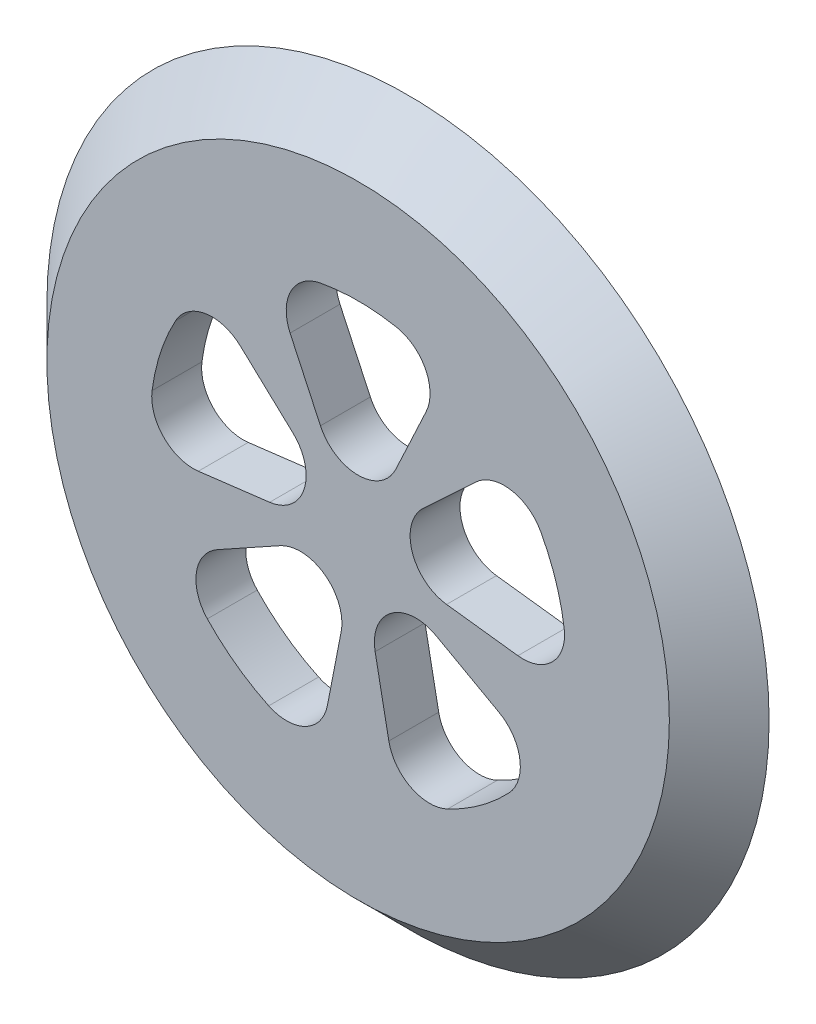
ISO-10303-21;
HEADER;
FILE_DESCRIPTION(('STEP AP214'),'2;1');
FILE_NAME('part.step','',(''),(''),'','','');
FILE_SCHEMA(('AUTOMOTIVE_DESIGN { 1 0 10303 214 1 1 1 1 }'));
ENDSEC;
DATA;
#1=APPLICATION_CONTEXT('core data for automotive mechanical design processes');
#2=APPLICATION_PROTOCOL_DEFINITION('international standard','automotive_design',2000,#1);
#3=PRODUCT_CONTEXT('',#1,'mechanical');
#4=PRODUCT('Part','Part','',(#3));
#5=PRODUCT_RELATED_PRODUCT_CATEGORY('part','',(#4));
#6=PRODUCT_DEFINITION_FORMATION('','',#4);
#7=PRODUCT_DEFINITION_CONTEXT('part definition',#1,'design');
#8=PRODUCT_DEFINITION('design','',#6,#7);
#9=PRODUCT_DEFINITION_SHAPE('','',#8);
#10=(LENGTH_UNIT() NAMED_UNIT(*) SI_UNIT(.MILLI.,.METRE.));
#11=(NAMED_UNIT(*) PLANE_ANGLE_UNIT() SI_UNIT($,.RADIAN.));
#12=(NAMED_UNIT(*) SI_UNIT($,.STERADIAN.) SOLID_ANGLE_UNIT());
#13=UNCERTAINTY_MEASURE_WITH_UNIT(LENGTH_MEASURE(1.E-05),#10,'distance_accuracy_value','');
#14=(GEOMETRIC_REPRESENTATION_CONTEXT(3) GLOBAL_UNCERTAINTY_ASSIGNED_CONTEXT((#13)) GLOBAL_UNIT_ASSIGNED_CONTEXT((#10,
#11,#12)) REPRESENTATION_CONTEXT('',''));
#15=CARTESIAN_POINT('',(0.,0.,0.));
#16=DIRECTION('',(0.,0.,1.));
#17=DIRECTION('',(1.,0.,0.));
#18=AXIS2_PLACEMENT_3D('',#15,#16,#17);
#19=CARTESIAN_POINT('',(0.,0.,0.));
#20=DIRECTION('',(0.,0.,-1.));
#21=DIRECTION('',(1.,0.,0.));
#22=AXIS2_PLACEMENT_3D('',#19,#20,#21);
#23=CONICAL_SURFACE('',#22,2172.,0.78539816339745);
#24=CARTESIAN_POINT('',(0.,0.,300.));
#25=DIRECTION('',(0.,0.,1.));
#26=DIRECTION('',(1.,0.,0.));
#27=AXIS2_PLACEMENT_3D('',#24,#25,#26);
#28=CIRCLE('',#27,1872.);
#29=CARTESIAN_POINT('',(1872.,0.,300.));
#30=VERTEX_POINT('',#29);
#31=EDGE_CURVE('E11',#30,#30,#28,.T.);
#32=ORIENTED_EDGE('',*,*,#31,.F.);
#33=EDGE_LOOP('',(#32));
#34=FACE_BOUND('',#33,.T.);
#35=CARTESIAN_POINT('',(0.,0.,0.));
#36=DIRECTION('',(0.,0.,1.));
#37=DIRECTION('',(1.,0.,0.));
#38=AXIS2_PLACEMENT_3D('',#35,#36,#37);
#39=CIRCLE('',#38,2172.);
#40=CARTESIAN_POINT('',(2172.,0.,0.));
#41=VERTEX_POINT('',#40);
#42=EDGE_CURVE('E44',#41,#41,#39,.T.);
#43=ORIENTED_EDGE('',*,*,#42,.T.);
#44=EDGE_LOOP('',(#43));
#45=FACE_BOUND('',#44,.T.);
#46=ADVANCED_FACE('F37',(#34,#45),#23,.T.);
#47=CARTESIAN_POINT('',(0.,0.,300.));
#48=DIRECTION('',(0.,0.,1.));
#49=DIRECTION('',(1.,0.,0.));
#50=AXIS2_PLACEMENT_3D('',#47,#48,#49);
#51=PLANE('',#50);
#52=CARTESIAN_POINT('',(991.49601476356,130.137053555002,300.));
#53=DIRECTION('',(0.,0.,1.));
#54=DIRECTION('',(-0.309016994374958,0.95105651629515,0.));
#55=AXIS2_PLACEMENT_3D('',#52,#53,#54);
#56=CIRCLE('',#55,250.);
#57=CARTESIAN_POINT('',(961.028678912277,-117.999484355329,300.));
#58=VERTEX_POINT('',#57);
#59=CARTESIAN_POINT('',(1239.37001845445,162.671316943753,300.));
#60=VERTEX_POINT('',#59);
#61=EDGE_CURVE('E51',#58,#60,#56,.T.);
#62=ORIENTED_EDGE('',*,*,#61,.F.);
#63=DIRECTION('',(0.992546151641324,-0.121869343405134,0.));
#64=VECTOR('',#63,1.);
#65=CARTESIAN_POINT('',(532.130522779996,-65.3374125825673,300.));
#66=LINE('',#65,#64);
#67=CARTESIAN_POINT('',(532.130522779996,-65.3374125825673,300.));
#68=VERTEX_POINT('',#67);
#69=EDGE_CURVE('E344',#68,#58,#66,.T.);
#70=ORIENTED_EDGE('',*,*,#69,.F.);
#71=CARTESIAN_POINT('',(562.597858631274,182.799125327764,300.));
#72=DIRECTION('',(0.,0.,1.));
#73=DIRECTION('',(0.309016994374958,-0.95105651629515,0.));
#74=AXIS2_PLACEMENT_3D('',#71,#72,#73);
#75=CIRCLE('',#74,250.);
#76=CARTESIAN_POINT('',(392.098268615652,365.637550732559,300.));
#77=VERTEX_POINT('',#76);
#78=EDGE_CURVE('E370',#77,#68,#75,.T.);
#79=ORIENTED_EDGE('',*,*,#78,.F.);
#80=DIRECTION('',(-0.731353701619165,-0.681998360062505,0.));
#81=VECTOR('',#80,1.);
#82=CARTESIAN_POINT('',(708.130176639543,660.342072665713,300.));
#83=LINE('',#82,#81);
#84=CARTESIAN_POINT('',(708.130176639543,660.342072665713,300.));
#85=VERTEX_POINT('',#84);
#86=EDGE_CURVE('E367',#85,#77,#83,.T.);
#87=ORIENTED_EDGE('',*,*,#86,.F.);
#88=CARTESIAN_POINT('',(878.629766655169,477.503647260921,300.));
#89=DIRECTION('',(0.,0.,1.));
#90=DIRECTION('',(0.309016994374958,-0.95105651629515,0.));
#91=AXIS2_PLACEMENT_3D('',#88,#89,#90);
#92=CIRCLE('',#91,250.);
#93=CARTESIAN_POINT('',(1098.28720831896,596.879559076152,300.));
#94=VERTEX_POINT('',#93);
#95=EDGE_CURVE('E364',#94,#85,#92,.T.);
#96=ORIENTED_EDGE('',*,*,#95,.F.);
#97=CARTESIAN_POINT('',(0.,0.,300.));
#98=DIRECTION('',(0.,0.,1.));
#99=DIRECTION('',(-0.309016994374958,0.95105651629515,0.));
#100=AXIS2_PLACEMENT_3D('',#97,#98,#99);
#101=CIRCLE('',#100,1250.);
#102=EDGE_CURVE('E361',#60,#94,#101,.T.);
#103=ORIENTED_EDGE('',*,*,#102,.F.);
#104=EDGE_LOOP('',(#62,#70,#79,#87,#96,#103));
#105=FACE_BOUND('',#104,.T.);
#106=CARTESIAN_POINT('',(430.156811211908,-902.754184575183,300.));
#107=DIRECTION('',(0.,0.,1.));
#108=DIRECTION('',(0.809016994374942,0.58778525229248,0.));
#109=AXIS2_PLACEMENT_3D('',#106,#107,#108);
#110=CIRCLE('',#109,250.);
#111=CARTESIAN_POINT('',(184.750015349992,-950.456433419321,300.));
#112=VERTEX_POINT('',#111);
#113=CARTESIAN_POINT('',(537.696014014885,-1128.44273071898,300.));
#114=VERTEX_POINT('',#113);
#115=EDGE_CURVE('E59',#112,#114,#110,.T.);
#116=ORIENTED_EDGE('',*,*,#115,.F.);
#117=DIRECTION('',(0.190808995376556,-0.981627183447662,0.));
#118=VECTOR('',#117,1.);
#119=CARTESIAN_POINT('',(102.297802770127,-526.276572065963,300.));
#120=LINE('',#119,#118);
#121=CARTESIAN_POINT('',(102.297802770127,-526.276572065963,300.));
#122=VERTEX_POINT('',#121);
#123=EDGE_CURVE('E298',#122,#112,#120,.T.);
#124=ORIENTED_EDGE('',*,*,#123,.F.);
#125=CARTESIAN_POINT('',(347.704598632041,-478.574323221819,300.));
#126=DIRECTION('',(0.,0.,1.));
#127=DIRECTION('',(-0.809016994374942,-0.58778525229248,0.));
#128=AXIS2_PLACEMENT_3D('',#125,#126,#127);
#129=CIRCLE('',#128,250.);
#130=CARTESIAN_POINT('',(468.907003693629,-259.919396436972,300.));
#131=VERTEX_POINT('',#130);
#132=EDGE_CURVE('E325',#131,#122,#129,.T.);
#133=ORIENTED_EDGE('',*,*,#132,.F.);
#134=DIRECTION('',(-0.874619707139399,0.484809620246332,0.));
#135=VECTOR('',#134,1.);
#136=CARTESIAN_POINT('',(846.846890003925,-469.414896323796,300.));
#137=LINE('',#136,#135);
#138=CARTESIAN_POINT('',(846.846890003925,-469.414896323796,300.));
#139=VERTEX_POINT('',#138);
#140=EDGE_CURVE('E322',#139,#131,#137,.T.);
#141=ORIENTED_EDGE('',*,*,#140,.F.);
#142=CARTESIAN_POINT('',(725.644484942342,-688.069823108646,300.));
#143=DIRECTION('',(0.,0.,1.));
#144=DIRECTION('',(-0.809016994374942,-0.58778525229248,0.));
#145=AXIS2_PLACEMENT_3D('',#142,#143,#144);
#146=CIRCLE('',#145,250.);
#147=CARTESIAN_POINT('',(907.055606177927,-860.087278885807,300.));
#148=VERTEX_POINT('',#147);
#149=EDGE_CURVE('E319',#148,#139,#146,.T.);
#150=ORIENTED_EDGE('',*,*,#149,.F.);
#151=CARTESIAN_POINT('',(0.,0.,300.));
#152=DIRECTION('',(0.,0.,1.));
#153=DIRECTION('',(0.809016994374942,0.58778525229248,0.));
#154=AXIS2_PLACEMENT_3D('',#151,#152,#153);
#155=CIRCLE('',#154,1250.);
#156=EDGE_CURVE('E315',#114,#148,#155,.T.);
#157=ORIENTED_EDGE('',*,*,#156,.F.);
#158=EDGE_LOOP('',(#116,#124,#133,#141,#150,#157));
#159=FACE_BOUND('',#158,.T.);
#160=CARTESIAN_POINT('',(-725.644484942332,-688.069823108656,300.));
#161=DIRECTION('',(0.,0.,1.));
#162=DIRECTION('',(0.809016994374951,-0.587785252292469,0.));
#163=AXIS2_PLACEMENT_3D('',#160,#161,#162);
#164=CIRCLE('',#163,250.);
#165=CARTESIAN_POINT('',(-846.846890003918,-469.414896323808,300.));
#166=VERTEX_POINT('',#165);
#167=CARTESIAN_POINT('',(-907.055606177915,-860.087278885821,300.));
#168=VERTEX_POINT('',#167);
#169=EDGE_CURVE('E240',#166,#168,#164,.T.);
#170=ORIENTED_EDGE('',*,*,#169,.F.);
#171=DIRECTION('',(-0.874619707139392,-0.484809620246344,0.));
#172=VECTOR('',#171,1.);
#173=CARTESIAN_POINT('',(-468.907003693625,-259.919396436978,300.));
#174=LINE('',#173,#172);
#175=CARTESIAN_POINT('',(-468.907003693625,-259.919396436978,300.));
#176=VERTEX_POINT('',#175);
#177=EDGE_CURVE('E259',#176,#166,#174,.T.);
#178=ORIENTED_EDGE('',*,*,#177,.F.);
#179=CARTESIAN_POINT('',(-347.704598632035,-478.574323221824,300.));
#180=DIRECTION('',(0.,0.,1.));
#181=DIRECTION('',(-0.809016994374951,0.587785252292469,0.));
#182=AXIS2_PLACEMENT_3D('',#179,#180,#181);
#183=CIRCLE('',#182,250.);
#184=CARTESIAN_POINT('',(-102.297802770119,-526.276572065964,300.));
#185=VERTEX_POINT('',#184);
#186=EDGE_CURVE('E262',#185,#176,#183,.T.);
#187=ORIENTED_EDGE('',*,*,#186,.F.);
#188=DIRECTION('',(0.190808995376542,0.981627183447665,0.));
#189=VECTOR('',#188,1.);
#190=CARTESIAN_POINT('',(-184.750015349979,-950.456433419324,300.));
#191=LINE('',#190,#189);
#192=CARTESIAN_POINT('',(-184.750015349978,-950.456433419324,300.));
#193=VERTEX_POINT('',#192);
#194=EDGE_CURVE('E279',#193,#185,#191,.T.);
#195=ORIENTED_EDGE('',*,*,#194,.F.);
#196=CARTESIAN_POINT('',(-430.156811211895,-902.754184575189,300.));
#197=DIRECTION('',(0.,0.,1.));
#198=DIRECTION('',(-0.809016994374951,0.587785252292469,0.));
#199=AXIS2_PLACEMENT_3D('',#196,#197,#198);
#200=CIRCLE('',#199,250.);
#201=CARTESIAN_POINT('',(-537.696014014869,-1128.44273071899,300.));
#202=VERTEX_POINT('',#201);
#203=EDGE_CURVE('E276',#202,#193,#200,.T.);
#204=ORIENTED_EDGE('',*,*,#203,.F.);
#205=CARTESIAN_POINT('',(0.,0.,300.));
#206=DIRECTION('',(0.,0.,1.));
#207=DIRECTION('',(0.809016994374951,-0.587785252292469,0.));
#208=AXIS2_PLACEMENT_3D('',#205,#206,#207);
#209=CIRCLE('',#208,1250.);
#210=EDGE_CURVE('E273',#168,#202,#209,.T.);
#211=ORIENTED_EDGE('',*,*,#210,.F.);
#212=EDGE_LOOP('',(#170,#178,#187,#195,#204,#211));
#213=FACE_BOUND('',#212,.T.);
#214=CARTESIAN_POINT('',(-878.629766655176,477.503647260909,300.));
#215=DIRECTION('',(0.,0.,1.));
#216=DIRECTION('',(-0.309016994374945,-0.951056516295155,0.));
#217=AXIS2_PLACEMENT_3D('',#214,#215,#216);
#218=CIRCLE('',#217,250.);
#219=CARTESIAN_POINT('',(-708.130176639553,660.342072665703,300.));
#220=VERTEX_POINT('',#219);
#221=CARTESIAN_POINT('',(-1098.28720831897,596.879559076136,300.));
#222=VERTEX_POINT('',#221);
#223=EDGE_CURVE('E286',#220,#222,#218,.T.);
#224=ORIENTED_EDGE('',*,*,#223,.F.);
#225=DIRECTION('',(-0.731353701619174,0.681998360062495,0.));
#226=VECTOR('',#225,1.);
#227=CARTESIAN_POINT('',(-392.098268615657,365.637550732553,300.));
#228=LINE('',#227,#226);
#229=CARTESIAN_POINT('',(-392.098268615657,365.637550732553,300.));
#230=VERTEX_POINT('',#229);
#231=EDGE_CURVE('E389',#230,#220,#228,.T.);
#232=ORIENTED_EDGE('',*,*,#231,.F.);
#233=CARTESIAN_POINT('',(-562.597858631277,182.799125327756,300.));
#234=DIRECTION('',(0.,0.,1.));
#235=DIRECTION('',(0.309016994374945,0.951056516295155,0.));
#236=AXIS2_PLACEMENT_3D('',#233,#234,#235);
#237=CIRCLE('',#236,250.);
#238=CARTESIAN_POINT('',(-532.130522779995,-65.3374125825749,300.));
#239=VERTEX_POINT('',#238);
#240=EDGE_CURVE('E415',#239,#230,#237,.T.);
#241=ORIENTED_EDGE('',*,*,#240,.F.);
#242=DIRECTION('',(0.992546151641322,0.121869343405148,0.));
#243=VECTOR('',#242,1.);
#244=CARTESIAN_POINT('',(-961.028678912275,-117.999484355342,300.));
#245=LINE('',#244,#243);
#246=CARTESIAN_POINT('',(-961.028678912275,-117.999484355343,300.));
#247=VERTEX_POINT('',#246);
#248=EDGE_CURVE('E412',#247,#239,#245,.T.);
#249=ORIENTED_EDGE('',*,*,#248,.F.);
#250=CARTESIAN_POINT('',(-991.496014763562,130.137053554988,300.));
#251=DIRECTION('',(0.,0.,1.));
#252=DIRECTION('',(0.309016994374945,0.951056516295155,0.));
#253=AXIS2_PLACEMENT_3D('',#250,#251,#252);
#254=CIRCLE('',#253,250.);
#255=CARTESIAN_POINT('',(-1239.37001845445,162.671316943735,300.));
#256=VERTEX_POINT('',#255);
#257=EDGE_CURVE('E409',#256,#247,#254,.T.);
#258=ORIENTED_EDGE('',*,*,#257,.F.);
#259=CARTESIAN_POINT('',(0.,0.,300.));
#260=DIRECTION('',(0.,0.,1.));
#261=DIRECTION('',(-0.309016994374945,-0.951056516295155,0.));
#262=AXIS2_PLACEMENT_3D('',#259,#260,#261);
#263=CIRCLE('',#262,1250.);
#264=EDGE_CURVE('E406',#222,#256,#263,.T.);
#265=ORIENTED_EDGE('',*,*,#264,.F.);
#266=EDGE_LOOP('',(#224,#232,#241,#249,#258,#265));
#267=FACE_BOUND('',#266,.T.);
#268=CARTESIAN_POINT('',(182.621425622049,983.183306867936,300.));
#269=DIRECTION('',(0.,0.,1.));
#270=DIRECTION('',(-1.,0.,0.));
#271=AXIS2_PLACEMENT_3D('',#268,#269,#270);
#272=CIRCLE('',#271,250.);
#273=CARTESIAN_POINT('',(409.198372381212,877.528741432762,300.));
#274=VERTEX_POINT('',#273);
#275=CARTESIAN_POINT('',(228.276782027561,1228.97913358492,300.));
#276=VERTEX_POINT('',#275);
#277=EDGE_CURVE('E422',#274,#276,#272,.T.);
#278=ORIENTED_EDGE('',*,*,#277,.F.);
#279=DIRECTION('',(0.422618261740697,0.906307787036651,0.));
#280=VECTOR('',#279,1.);
#281=CARTESIAN_POINT('',(226.576946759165,485.895830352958,300.));
#282=LINE('',#281,#280);
#283=CARTESIAN_POINT('',(226.576946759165,485.895830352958,300.));
#284=VERTEX_POINT('',#283);
#285=EDGE_CURVE('E437',#284,#274,#282,.T.);
#286=ORIENTED_EDGE('',*,*,#285,.F.);
#287=CARTESIAN_POINT('',(0.,591.550395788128,300.));
#288=DIRECTION('',(0.,0.,1.));
#289=DIRECTION('',(1.,0.,0.));
#290=AXIS2_PLACEMENT_3D('',#287,#288,#289);
#291=CIRCLE('',#290,250.);
#292=CARTESIAN_POINT('',(-226.576946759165,485.895830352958,300.));
#293=VERTEX_POINT('',#292);
#294=EDGE_CURVE('E463',#293,#284,#291,.T.);
#295=ORIENTED_EDGE('',*,*,#294,.F.);
#296=DIRECTION('',(0.422618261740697,-0.906307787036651,0.));
#297=VECTOR('',#296,1.);
#298=CARTESIAN_POINT('',(-409.198372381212,877.528741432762,300.));
#299=LINE('',#298,#297);
#300=CARTESIAN_POINT('',(-409.198372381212,877.528741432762,300.));
#301=VERTEX_POINT('',#300);
#302=EDGE_CURVE('E460',#301,#293,#299,.T.);
#303=ORIENTED_EDGE('',*,*,#302,.F.);
#304=CARTESIAN_POINT('',(-182.621425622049,983.183306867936,300.));
#305=DIRECTION('',(0.,0.,1.));
#306=DIRECTION('',(1.,0.,0.));
#307=AXIS2_PLACEMENT_3D('',#304,#305,#306);
#308=CIRCLE('',#307,250.);
#309=CARTESIAN_POINT('',(-228.276782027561,1228.97913358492,300.));
#310=VERTEX_POINT('',#309);
#311=EDGE_CURVE('E457',#310,#301,#308,.T.);
#312=ORIENTED_EDGE('',*,*,#311,.F.);
#313=CARTESIAN_POINT('',(0.,0.,300.));
#314=DIRECTION('',(0.,0.,1.));
#315=DIRECTION('',(-1.,0.,0.));
#316=AXIS2_PLACEMENT_3D('',#313,#314,#315);
#317=CIRCLE('',#316,1250.);
#318=EDGE_CURVE('E454',#276,#310,#317,.T.);
#319=ORIENTED_EDGE('',*,*,#318,.F.);
#320=EDGE_LOOP('',(#278,#286,#295,#303,#312,#319));
#321=FACE_BOUND('',#320,.T.);
#322=ORIENTED_EDGE('',*,*,#31,.T.);
#323=EDGE_LOOP('',(#322));
#324=FACE_BOUND('',#323,.T.);
#325=ADVANCED_FACE('F485',(#105,#159,#213,#267,#321,#324),#51,.T.);
#326=CARTESIAN_POINT('',(0.,0.,0.));
#327=DIRECTION('',(0.,0.,1.));
#328=DIRECTION('',(1.,0.,0.));
#329=AXIS2_PLACEMENT_3D('',#326,#327,#328);
#330=PLANE('',#329);
#331=DIRECTION('',(0.992546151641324,-0.121869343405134,0.));
#332=VECTOR('',#331,1.);
#333=CARTESIAN_POINT('',(532.130522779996,-65.3374125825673,0.));
#334=LINE('',#333,#332);
#335=CARTESIAN_POINT('',(532.130522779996,-65.3374125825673,0.));
#336=VERTEX_POINT('',#335);
#337=CARTESIAN_POINT('',(961.028678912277,-117.999484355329,0.));
#338=VERTEX_POINT('',#337);
#339=EDGE_CURVE('E356',#336,#338,#334,.T.);
#340=ORIENTED_EDGE('',*,*,#339,.T.);
#341=CARTESIAN_POINT('',(991.49601476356,130.137053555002,0.));
#342=DIRECTION('',(0.,0.,1.));
#343=DIRECTION('',(-0.309016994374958,0.95105651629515,0.));
#344=AXIS2_PLACEMENT_3D('',#341,#342,#343);
#345=CIRCLE('',#344,250.);
#346=CARTESIAN_POINT('',(1239.37001845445,162.671316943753,0.));
#347=VERTEX_POINT('',#346);
#348=EDGE_CURVE('E340',#338,#347,#345,.T.);
#349=ORIENTED_EDGE('',*,*,#348,.T.);
#350=CARTESIAN_POINT('',(0.,0.,0.));
#351=DIRECTION('',(0.,0.,1.));
#352=DIRECTION('',(-0.309016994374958,0.95105651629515,0.));
#353=AXIS2_PLACEMENT_3D('',#350,#351,#352);
#354=CIRCLE('',#353,1250.);
#355=CARTESIAN_POINT('',(1098.28720831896,596.879559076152,0.));
#356=VERTEX_POINT('',#355);
#357=EDGE_CURVE('E343',#347,#356,#354,.T.);
#358=ORIENTED_EDGE('',*,*,#357,.T.);
#359=CARTESIAN_POINT('',(878.629766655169,477.503647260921,0.));
#360=DIRECTION('',(0.,0.,1.));
#361=DIRECTION('',(0.309016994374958,-0.95105651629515,0.));
#362=AXIS2_PLACEMENT_3D('',#359,#360,#361);
#363=CIRCLE('',#362,250.);
#364=CARTESIAN_POINT('',(708.130176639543,660.342072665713,0.));
#365=VERTEX_POINT('',#364);
#366=EDGE_CURVE('E347',#356,#365,#363,.T.);
#367=ORIENTED_EDGE('',*,*,#366,.T.);
#368=DIRECTION('',(-0.731353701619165,-0.681998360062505,0.));
#369=VECTOR('',#368,1.);
#370=CARTESIAN_POINT('',(708.130176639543,660.342072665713,0.));
#371=LINE('',#370,#369);
#372=CARTESIAN_POINT('',(392.098268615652,365.637550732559,0.));
#373=VERTEX_POINT('',#372);
#374=EDGE_CURVE('E350',#365,#373,#371,.T.);
#375=ORIENTED_EDGE('',*,*,#374,.T.);
#376=CARTESIAN_POINT('',(562.597858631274,182.799125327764,0.));
#377=DIRECTION('',(0.,0.,1.));
#378=DIRECTION('',(0.309016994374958,-0.95105651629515,0.));
#379=AXIS2_PLACEMENT_3D('',#376,#377,#378);
#380=CIRCLE('',#379,250.);
#381=EDGE_CURVE('E353',#373,#336,#380,.T.);
#382=ORIENTED_EDGE('',*,*,#381,.T.);
#383=EDGE_LOOP('',(#340,#349,#358,#367,#375,#382));
#384=FACE_BOUND('',#383,.T.);
#385=DIRECTION('',(0.190808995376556,-0.981627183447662,0.));
#386=VECTOR('',#385,1.);
#387=CARTESIAN_POINT('',(102.297802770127,-526.276572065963,0.));
#388=LINE('',#387,#386);
#389=CARTESIAN_POINT('',(102.297802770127,-526.276572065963,0.));
#390=VERTEX_POINT('',#389);
#391=CARTESIAN_POINT('',(184.750015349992,-950.456433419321,0.));
#392=VERTEX_POINT('',#391);
#393=EDGE_CURVE('E310',#390,#392,#388,.T.);
#394=ORIENTED_EDGE('',*,*,#393,.T.);
#395=CARTESIAN_POINT('',(430.156811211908,-902.754184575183,0.));
#396=DIRECTION('',(0.,0.,1.));
#397=DIRECTION('',(0.809016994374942,0.58778525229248,0.));
#398=AXIS2_PLACEMENT_3D('',#395,#396,#397);
#399=CIRCLE('',#398,250.);
#400=CARTESIAN_POINT('',(537.696014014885,-1128.44273071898,0.));
#401=VERTEX_POINT('',#400);
#402=EDGE_CURVE('E294',#392,#401,#399,.T.);
#403=ORIENTED_EDGE('',*,*,#402,.T.);
#404=CARTESIAN_POINT('',(0.,0.,0.));
#405=DIRECTION('',(0.,0.,1.));
#406=DIRECTION('',(0.809016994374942,0.58778525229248,0.));
#407=AXIS2_PLACEMENT_3D('',#404,#405,#406);
#408=CIRCLE('',#407,1250.);
#409=CARTESIAN_POINT('',(907.055606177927,-860.087278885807,0.));
#410=VERTEX_POINT('',#409);
#411=EDGE_CURVE('E297',#401,#410,#408,.T.);
#412=ORIENTED_EDGE('',*,*,#411,.T.);
#413=CARTESIAN_POINT('',(725.644484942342,-688.069823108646,0.));
#414=DIRECTION('',(0.,0.,1.));
#415=DIRECTION('',(-0.809016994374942,-0.58778525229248,0.));
#416=AXIS2_PLACEMENT_3D('',#413,#414,#415);
#417=CIRCLE('',#416,250.);
#418=CARTESIAN_POINT('',(846.846890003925,-469.414896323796,0.));
#419=VERTEX_POINT('',#418);
#420=EDGE_CURVE('E301',#410,#419,#417,.T.);
#421=ORIENTED_EDGE('',*,*,#420,.T.);
#422=DIRECTION('',(-0.874619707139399,0.484809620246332,0.));
#423=VECTOR('',#422,1.);
#424=CARTESIAN_POINT('',(846.846890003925,-469.414896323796,0.));
#425=LINE('',#424,#423);
#426=CARTESIAN_POINT('',(468.907003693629,-259.919396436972,0.));
#427=VERTEX_POINT('',#426);
#428=EDGE_CURVE('E304',#419,#427,#425,.T.);
#429=ORIENTED_EDGE('',*,*,#428,.T.);
#430=CARTESIAN_POINT('',(347.704598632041,-478.574323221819,0.));
#431=DIRECTION('',(0.,0.,1.));
#432=DIRECTION('',(-0.809016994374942,-0.58778525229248,0.));
#433=AXIS2_PLACEMENT_3D('',#430,#431,#432);
#434=CIRCLE('',#433,250.);
#435=EDGE_CURVE('E307',#427,#390,#434,.T.);
#436=ORIENTED_EDGE('',*,*,#435,.T.);
#437=EDGE_LOOP('',(#394,#403,#412,#421,#429,#436));
#438=FACE_BOUND('',#437,.T.);
#439=DIRECTION('',(-0.874619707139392,-0.484809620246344,0.));
#440=VECTOR('',#439,1.);
#441=CARTESIAN_POINT('',(-468.907003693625,-259.919396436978,0.));
#442=LINE('',#441,#440);
#443=CARTESIAN_POINT('',(-468.907003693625,-259.919396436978,0.));
#444=VERTEX_POINT('',#443);
#445=CARTESIAN_POINT('',(-846.846890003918,-469.414896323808,0.));
#446=VERTEX_POINT('',#445);
#447=EDGE_CURVE('E245',#444,#446,#442,.T.);
#448=ORIENTED_EDGE('',*,*,#447,.T.);
#449=CARTESIAN_POINT('',(-725.644484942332,-688.069823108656,0.));
#450=DIRECTION('',(0.,0.,1.));
#451=DIRECTION('',(0.809016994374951,-0.587785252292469,0.));
#452=AXIS2_PLACEMENT_3D('',#449,#450,#451);
#453=CIRCLE('',#452,250.);
#454=CARTESIAN_POINT('',(-907.055606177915,-860.087278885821,0.));
#455=VERTEX_POINT('',#454);
#456=EDGE_CURVE('E237',#446,#455,#453,.T.);
#457=ORIENTED_EDGE('',*,*,#456,.T.);
#458=CARTESIAN_POINT('',(0.,0.,0.));
#459=DIRECTION('',(0.,0.,1.));
#460=DIRECTION('',(0.809016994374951,-0.587785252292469,0.));
#461=AXIS2_PLACEMENT_3D('',#458,#459,#460);
#462=CIRCLE('',#461,1250.);
#463=CARTESIAN_POINT('',(-537.696014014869,-1128.44273071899,0.));
#464=VERTEX_POINT('',#463);
#465=EDGE_CURVE('E249',#455,#464,#462,.T.);
#466=ORIENTED_EDGE('',*,*,#465,.T.);
#467=CARTESIAN_POINT('',(-430.156811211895,-902.754184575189,0.));
#468=DIRECTION('',(0.,0.,1.));
#469=DIRECTION('',(-0.809016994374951,0.587785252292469,0.));
#470=AXIS2_PLACEMENT_3D('',#467,#468,#469);
#471=CIRCLE('',#470,250.);
#472=CARTESIAN_POINT('',(-184.750015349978,-950.456433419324,0.));
#473=VERTEX_POINT('',#472);
#474=EDGE_CURVE('E253',#464,#473,#471,.T.);
#475=ORIENTED_EDGE('',*,*,#474,.T.);
#476=DIRECTION('',(0.190808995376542,0.981627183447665,0.));
#477=VECTOR('',#476,1.);
#478=CARTESIAN_POINT('',(-184.750015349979,-950.456433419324,0.));
#479=LINE('',#478,#477);
#480=CARTESIAN_POINT('',(-102.297802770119,-526.276572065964,0.));
#481=VERTEX_POINT('',#480);
#482=EDGE_CURVE('E266',#473,#481,#479,.T.);
#483=ORIENTED_EDGE('',*,*,#482,.T.);
#484=CARTESIAN_POINT('',(-347.704598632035,-478.574323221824,0.));
#485=DIRECTION('',(0.,0.,1.));
#486=DIRECTION('',(-0.809016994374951,0.587785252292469,0.));
#487=AXIS2_PLACEMENT_3D('',#484,#485,#486);
#488=CIRCLE('',#487,250.);
#489=EDGE_CURVE('E269',#481,#444,#488,.T.);
#490=ORIENTED_EDGE('',*,*,#489,.T.);
#491=EDGE_LOOP('',(#448,#457,#466,#475,#483,#490));
#492=FACE_BOUND('',#491,.T.);
#493=DIRECTION('',(-0.731353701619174,0.681998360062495,0.));
#494=VECTOR('',#493,1.);
#495=CARTESIAN_POINT('',(-392.098268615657,365.637550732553,0.));
#496=LINE('',#495,#494);
#497=CARTESIAN_POINT('',(-392.098268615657,365.637550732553,0.));
#498=VERTEX_POINT('',#497);
#499=CARTESIAN_POINT('',(-708.130176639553,660.342072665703,0.));
#500=VERTEX_POINT('',#499);
#501=EDGE_CURVE('E401',#498,#500,#496,.T.);
#502=ORIENTED_EDGE('',*,*,#501,.T.);
#503=CARTESIAN_POINT('',(-878.629766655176,477.503647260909,0.));
#504=DIRECTION('',(0.,0.,1.));
#505=DIRECTION('',(-0.309016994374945,-0.951056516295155,0.));
#506=AXIS2_PLACEMENT_3D('',#503,#504,#505);
#507=CIRCLE('',#506,250.);
#508=CARTESIAN_POINT('',(-1098.28720831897,596.879559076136,0.));
#509=VERTEX_POINT('',#508);
#510=EDGE_CURVE('E385',#500,#509,#507,.T.);
#511=ORIENTED_EDGE('',*,*,#510,.T.);
#512=CARTESIAN_POINT('',(0.,0.,0.));
#513=DIRECTION('',(0.,0.,1.));
#514=DIRECTION('',(-0.309016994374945,-0.951056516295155,0.));
#515=AXIS2_PLACEMENT_3D('',#512,#513,#514);
#516=CIRCLE('',#515,1250.);
#517=CARTESIAN_POINT('',(-1239.37001845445,162.671316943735,0.));
#518=VERTEX_POINT('',#517);
#519=EDGE_CURVE('E388',#509,#518,#516,.T.);
#520=ORIENTED_EDGE('',*,*,#519,.T.);
#521=CARTESIAN_POINT('',(-991.496014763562,130.137053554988,0.));
#522=DIRECTION('',(0.,0.,1.));
#523=DIRECTION('',(0.309016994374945,0.951056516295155,0.));
#524=AXIS2_PLACEMENT_3D('',#521,#522,#523);
#525=CIRCLE('',#524,250.);
#526=CARTESIAN_POINT('',(-961.028678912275,-117.999484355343,0.));
#527=VERTEX_POINT('',#526);
#528=EDGE_CURVE('E392',#518,#527,#525,.T.);
#529=ORIENTED_EDGE('',*,*,#528,.T.);
#530=DIRECTION('',(0.992546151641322,0.121869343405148,0.));
#531=VECTOR('',#530,1.);
#532=CARTESIAN_POINT('',(-961.028678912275,-117.999484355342,0.));
#533=LINE('',#532,#531);
#534=CARTESIAN_POINT('',(-532.130522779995,-65.3374125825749,0.));
#535=VERTEX_POINT('',#534);
#536=EDGE_CURVE('E395',#527,#535,#533,.T.);
#537=ORIENTED_EDGE('',*,*,#536,.T.);
#538=CARTESIAN_POINT('',(-562.597858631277,182.799125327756,0.));
#539=DIRECTION('',(0.,0.,1.));
#540=DIRECTION('',(0.309016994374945,0.951056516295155,0.));
#541=AXIS2_PLACEMENT_3D('',#538,#539,#540);
#542=CIRCLE('',#541,250.);
#543=EDGE_CURVE('E398',#535,#498,#542,.T.);
#544=ORIENTED_EDGE('',*,*,#543,.T.);
#545=EDGE_LOOP('',(#502,#511,#520,#529,#537,#544));
#546=FACE_BOUND('',#545,.T.);
#547=DIRECTION('',(0.422618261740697,0.906307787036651,0.));
#548=VECTOR('',#547,1.);
#549=CARTESIAN_POINT('',(226.576946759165,485.895830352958,0.));
#550=LINE('',#549,#548);
#551=CARTESIAN_POINT('',(226.576946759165,485.895830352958,0.));
#552=VERTEX_POINT('',#551);
#553=CARTESIAN_POINT('',(409.198372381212,877.528741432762,0.));
#554=VERTEX_POINT('',#553);
#555=EDGE_CURVE('E449',#552,#554,#550,.T.);
#556=ORIENTED_EDGE('',*,*,#555,.T.);
#557=CARTESIAN_POINT('',(182.621425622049,983.183306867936,0.));
#558=DIRECTION('',(0.,0.,1.));
#559=DIRECTION('',(-1.,0.,0.));
#560=AXIS2_PLACEMENT_3D('',#557,#558,#559);
#561=CIRCLE('',#560,250.);
#562=CARTESIAN_POINT('',(228.276782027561,1228.97913358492,0.));
#563=VERTEX_POINT('',#562);
#564=EDGE_CURVE('E433',#554,#563,#561,.T.);
#565=ORIENTED_EDGE('',*,*,#564,.T.);
#566=CARTESIAN_POINT('',(0.,0.,0.));
#567=DIRECTION('',(0.,0.,1.));
#568=DIRECTION('',(-1.,0.,0.));
#569=AXIS2_PLACEMENT_3D('',#566,#567,#568);
#570=CIRCLE('',#569,1250.);
#571=CARTESIAN_POINT('',(-228.276782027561,1228.97913358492,0.));
#572=VERTEX_POINT('',#571);
#573=EDGE_CURVE('E436',#563,#572,#570,.T.);
#574=ORIENTED_EDGE('',*,*,#573,.T.);
#575=CARTESIAN_POINT('',(-182.621425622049,983.183306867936,0.));
#576=DIRECTION('',(0.,0.,1.));
#577=DIRECTION('',(1.,0.,0.));
#578=AXIS2_PLACEMENT_3D('',#575,#576,#577);
#579=CIRCLE('',#578,250.);
#580=CARTESIAN_POINT('',(-409.198372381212,877.528741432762,0.));
#581=VERTEX_POINT('',#580);
#582=EDGE_CURVE('E440',#572,#581,#579,.T.);
#583=ORIENTED_EDGE('',*,*,#582,.T.);
#584=DIRECTION('',(0.422618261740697,-0.906307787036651,0.));
#585=VECTOR('',#584,1.);
#586=CARTESIAN_POINT('',(-409.198372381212,877.528741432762,0.));
#587=LINE('',#586,#585);
#588=CARTESIAN_POINT('',(-226.576946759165,485.895830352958,0.));
#589=VERTEX_POINT('',#588);
#590=EDGE_CURVE('E443',#581,#589,#587,.T.);
#591=ORIENTED_EDGE('',*,*,#590,.T.);
#592=CARTESIAN_POINT('',(0.,591.550395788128,0.));
#593=DIRECTION('',(0.,0.,1.));
#594=DIRECTION('',(1.,0.,0.));
#595=AXIS2_PLACEMENT_3D('',#592,#593,#594);
#596=CIRCLE('',#595,250.);
#597=EDGE_CURVE('E446',#589,#552,#596,.T.);
#598=ORIENTED_EDGE('',*,*,#597,.T.);
#599=EDGE_LOOP('',(#556,#565,#574,#583,#591,#598));
#600=FACE_BOUND('',#599,.T.);
#601=ORIENTED_EDGE('',*,*,#42,.F.);
#602=EDGE_LOOP('',(#601));
#603=FACE_BOUND('',#602,.T.);
#604=ADVANCED_FACE('F255',(#384,#438,#492,#546,#600,#603),#330,.F.);
#605=CARTESIAN_POINT('',(182.621425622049,983.183306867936,0.));
#606=DIRECTION('',(0.,0.,1.));
#607=DIRECTION('',(1.,0.,0.));
#608=AXIS2_PLACEMENT_3D('',#605,#606,#607);
#609=CYLINDRICAL_SURFACE('',#608,250.);
#610=ORIENTED_EDGE('',*,*,#277,.T.);
#611=DIRECTION('',(0.,0.,1.));
#612=VECTOR('',#611,1.);
#613=CARTESIAN_POINT('',(228.276782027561,1228.97913358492,0.));
#614=LINE('',#613,#612);
#615=EDGE_CURVE('E452',#563,#276,#614,.T.);
#616=ORIENTED_EDGE('',*,*,#615,.F.);
#617=ORIENTED_EDGE('',*,*,#564,.F.);
#618=DIRECTION('',(0.,0.,1.));
#619=VECTOR('',#618,1.);
#620=CARTESIAN_POINT('',(409.198372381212,877.528741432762,0.));
#621=LINE('',#620,#619);
#622=EDGE_CURVE('E468',#554,#274,#621,.T.);
#623=ORIENTED_EDGE('',*,*,#622,.T.);
#624=EDGE_LOOP('',(#610,#616,#617,#623));
#625=FACE_BOUND('',#624,.T.);
#626=ADVANCED_FACE('F484',(#625),#609,.F.);
#627=CARTESIAN_POINT('',(226.576946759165,485.895830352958,0.));
#628=DIRECTION('',(0.906307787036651,-0.422618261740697,0.));
#629=DIRECTION('',(0.422618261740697,0.906307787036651,0.));
#630=AXIS2_PLACEMENT_3D('',#627,#628,#629);
#631=PLANE('',#630);
#632=ORIENTED_EDGE('',*,*,#285,.T.);
#633=ORIENTED_EDGE('',*,*,#622,.F.);
#634=ORIENTED_EDGE('',*,*,#555,.F.);
#635=DIRECTION('',(0.,0.,1.));
#636=VECTOR('',#635,1.);
#637=CARTESIAN_POINT('',(226.576946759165,485.895830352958,0.));
#638=LINE('',#637,#636);
#639=EDGE_CURVE('E470',#552,#284,#638,.T.);
#640=ORIENTED_EDGE('',*,*,#639,.T.);
#641=EDGE_LOOP('',(#632,#633,#634,#640));
#642=FACE_BOUND('',#641,.T.);
#643=ADVANCED_FACE('F491',(#642),#631,.F.);
#644=CARTESIAN_POINT('',(0.,591.550395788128,0.));
#645=DIRECTION('',(0.,0.,1.));
#646=DIRECTION('',(1.,0.,0.));
#647=AXIS2_PLACEMENT_3D('',#644,#645,#646);
#648=CYLINDRICAL_SURFACE('',#647,250.);
#649=ORIENTED_EDGE('',*,*,#294,.T.);
#650=ORIENTED_EDGE('',*,*,#639,.F.);
#651=ORIENTED_EDGE('',*,*,#597,.F.);
#652=DIRECTION('',(0.,0.,1.));
#653=VECTOR('',#652,1.);
#654=CARTESIAN_POINT('',(-226.576946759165,485.895830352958,0.));
#655=LINE('',#654,#653);
#656=EDGE_CURVE('E472',#589,#293,#655,.T.);
#657=ORIENTED_EDGE('',*,*,#656,.T.);
#658=EDGE_LOOP('',(#649,#650,#651,#657));
#659=FACE_BOUND('',#658,.T.);
#660=ADVANCED_FACE('F760',(#659),#648,.F.);
#661=CARTESIAN_POINT('',(-409.198372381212,877.528741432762,0.));
#662=DIRECTION('',(-0.906307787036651,-0.422618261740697,0.));
#663=DIRECTION('',(0.422618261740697,-0.906307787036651,0.));
#664=AXIS2_PLACEMENT_3D('',#661,#662,#663);
#665=PLANE('',#664);
#666=ORIENTED_EDGE('',*,*,#302,.T.);
#667=ORIENTED_EDGE('',*,*,#656,.F.);
#668=ORIENTED_EDGE('',*,*,#590,.F.);
#669=DIRECTION('',(0.,0.,1.));
#670=VECTOR('',#669,1.);
#671=CARTESIAN_POINT('',(-409.198372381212,877.528741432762,0.));
#672=LINE('',#671,#670);
#673=EDGE_CURVE('E474',#581,#301,#672,.T.);
#674=ORIENTED_EDGE('',*,*,#673,.T.);
#675=EDGE_LOOP('',(#666,#667,#668,#674));
#676=FACE_BOUND('',#675,.T.);
#677=ADVANCED_FACE('F764',(#676),#665,.F.);
#678=CARTESIAN_POINT('',(-182.621425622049,983.183306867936,0.));
#679=DIRECTION('',(0.,0.,1.));
#680=DIRECTION('',(1.,0.,0.));
#681=AXIS2_PLACEMENT_3D('',#678,#679,#680);
#682=CYLINDRICAL_SURFACE('',#681,250.);
#683=ORIENTED_EDGE('',*,*,#311,.T.);
#684=ORIENTED_EDGE('',*,*,#673,.F.);
#685=ORIENTED_EDGE('',*,*,#582,.F.);
#686=DIRECTION('',(0.,0.,1.));
#687=VECTOR('',#686,1.);
#688=CARTESIAN_POINT('',(-228.276782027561,1228.97913358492,0.));
#689=LINE('',#688,#687);
#690=EDGE_CURVE('E476',#572,#310,#689,.T.);
#691=ORIENTED_EDGE('',*,*,#690,.T.);
#692=EDGE_LOOP('',(#683,#684,#685,#691));
#693=FACE_BOUND('',#692,.T.);
#694=ADVANCED_FACE('F768',(#693),#682,.F.);
#695=CARTESIAN_POINT('',(0.,0.,0.));
#696=DIRECTION('',(0.,0.,1.));
#697=DIRECTION('',(1.,0.,0.));
#698=AXIS2_PLACEMENT_3D('',#695,#696,#697);
#699=CYLINDRICAL_SURFACE('',#698,1250.);
#700=ORIENTED_EDGE('',*,*,#318,.T.);
#701=ORIENTED_EDGE('',*,*,#690,.F.);
#702=ORIENTED_EDGE('',*,*,#573,.F.);
#703=ORIENTED_EDGE('',*,*,#615,.T.);
#704=EDGE_LOOP('',(#700,#701,#702,#703));
#705=FACE_BOUND('',#704,.T.);
#706=ADVANCED_FACE('F514',(#705),#699,.F.);
#707=CARTESIAN_POINT('',(-878.629766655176,477.503647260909,0.));
#708=DIRECTION('',(0.,0.,1.));
#709=DIRECTION('',(1.,0.,0.));
#710=AXIS2_PLACEMENT_3D('',#707,#708,#709);
#711=CYLINDRICAL_SURFACE('',#710,250.);
#712=ORIENTED_EDGE('',*,*,#223,.T.);
#713=DIRECTION('',(0.,0.,1.));
#714=VECTOR('',#713,1.);
#715=CARTESIAN_POINT('',(-1098.28720831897,596.879559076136,0.));
#716=LINE('',#715,#714);
#717=EDGE_CURVE('E404',#509,#222,#716,.T.);
#718=ORIENTED_EDGE('',*,*,#717,.F.);
#719=ORIENTED_EDGE('',*,*,#510,.F.);
#720=DIRECTION('',(0.,0.,1.));
#721=VECTOR('',#720,1.);
#722=CARTESIAN_POINT('',(-708.130176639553,660.342072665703,0.));
#723=LINE('',#722,#721);
#724=EDGE_CURVE('E420',#500,#220,#723,.T.);
#725=ORIENTED_EDGE('',*,*,#724,.T.);
#726=EDGE_LOOP('',(#712,#718,#719,#725));
#727=FACE_BOUND('',#726,.T.);
#728=ADVANCED_FACE('F524',(#727),#711,.F.);
#729=CARTESIAN_POINT('',(-392.098268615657,365.637550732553,0.));
#730=DIRECTION('',(0.681998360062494,0.731353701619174,0.));
#731=DIRECTION('',(-0.731353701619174,0.681998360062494,0.));
#732=AXIS2_PLACEMENT_3D('',#729,#730,#731);
#733=PLANE('',#732);
#734=ORIENTED_EDGE('',*,*,#231,.T.);
#735=ORIENTED_EDGE('',*,*,#724,.F.);
#736=ORIENTED_EDGE('',*,*,#501,.F.);
#737=DIRECTION('',(0.,0.,1.));
#738=VECTOR('',#737,1.);
#739=CARTESIAN_POINT('',(-392.098268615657,365.637550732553,0.));
#740=LINE('',#739,#738);
#741=EDGE_CURVE('E423',#498,#230,#740,.T.);
#742=ORIENTED_EDGE('',*,*,#741,.T.);
#743=EDGE_LOOP('',(#734,#735,#736,#742));
#744=FACE_BOUND('',#743,.T.);
#745=ADVANCED_FACE('F529',(#744),#733,.F.);
#746=CARTESIAN_POINT('',(-562.597858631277,182.799125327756,0.));
#747=DIRECTION('',(0.,0.,1.));
#748=DIRECTION('',(1.,0.,0.));
#749=AXIS2_PLACEMENT_3D('',#746,#747,#748);
#750=CYLINDRICAL_SURFACE('',#749,250.);
#751=ORIENTED_EDGE('',*,*,#240,.T.);
#752=ORIENTED_EDGE('',*,*,#741,.F.);
#753=ORIENTED_EDGE('',*,*,#543,.F.);
#754=DIRECTION('',(0.,0.,1.));
#755=VECTOR('',#754,1.);
#756=CARTESIAN_POINT('',(-532.130522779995,-65.3374125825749,0.));
#757=LINE('',#756,#755);
#758=EDGE_CURVE('E425',#535,#239,#757,.T.);
#759=ORIENTED_EDGE('',*,*,#758,.T.);
#760=EDGE_LOOP('',(#751,#752,#753,#759));
#761=FACE_BOUND('',#760,.T.);
#762=ADVANCED_FACE('F539',(#761),#750,.F.);
#763=CARTESIAN_POINT('',(-961.028678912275,-117.999484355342,0.));
#764=DIRECTION('',(0.121869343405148,-0.992546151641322,0.));
#765=DIRECTION('',(0.992546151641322,0.121869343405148,0.));
#766=AXIS2_PLACEMENT_3D('',#763,#764,#765);
#767=PLANE('',#766);
#768=ORIENTED_EDGE('',*,*,#248,.T.);
#769=ORIENTED_EDGE('',*,*,#758,.F.);
#770=ORIENTED_EDGE('',*,*,#536,.F.);
#771=DIRECTION('',(0.,0.,1.));
#772=VECTOR('',#771,1.);
#773=CARTESIAN_POINT('',(-961.028678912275,-117.999484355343,0.));
#774=LINE('',#773,#772);
#775=EDGE_CURVE('E427',#527,#247,#774,.T.);
#776=ORIENTED_EDGE('',*,*,#775,.T.);
#777=EDGE_LOOP('',(#768,#769,#770,#776));
#778=FACE_BOUND('',#777,.T.);
#779=ADVANCED_FACE('F549',(#778),#767,.F.);
#780=CARTESIAN_POINT('',(-991.496014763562,130.137053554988,0.));
#781=DIRECTION('',(0.,0.,1.));
#782=DIRECTION('',(1.,0.,0.));
#783=AXIS2_PLACEMENT_3D('',#780,#781,#782);
#784=CYLINDRICAL_SURFACE('',#783,250.);
#785=ORIENTED_EDGE('',*,*,#257,.T.);
#786=ORIENTED_EDGE('',*,*,#775,.F.);
#787=ORIENTED_EDGE('',*,*,#528,.F.);
#788=DIRECTION('',(0.,0.,1.));
#789=VECTOR('',#788,1.);
#790=CARTESIAN_POINT('',(-1239.37001845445,162.671316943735,0.));
#791=LINE('',#790,#789);
#792=EDGE_CURVE('E429',#518,#256,#791,.T.);
#793=ORIENTED_EDGE('',*,*,#792,.T.);
#794=EDGE_LOOP('',(#785,#786,#787,#793));
#795=FACE_BOUND('',#794,.T.);
#796=ADVANCED_FACE('F559',(#795),#784,.F.);
#797=CARTESIAN_POINT('',(0.,0.,0.));
#798=DIRECTION('',(0.,0.,1.));
#799=DIRECTION('',(1.,0.,0.));
#800=AXIS2_PLACEMENT_3D('',#797,#798,#799);
#801=CYLINDRICAL_SURFACE('',#800,1250.);
#802=ORIENTED_EDGE('',*,*,#264,.T.);
#803=ORIENTED_EDGE('',*,*,#792,.F.);
#804=ORIENTED_EDGE('',*,*,#519,.F.);
#805=ORIENTED_EDGE('',*,*,#717,.T.);
#806=EDGE_LOOP('',(#802,#803,#804,#805));
#807=FACE_BOUND('',#806,.T.);
#808=ADVANCED_FACE('F569',(#807),#801,.F.);
#809=CARTESIAN_POINT('',(-725.644484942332,-688.069823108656,0.));
#810=DIRECTION('',(0.,0.,1.));
#811=DIRECTION('',(1.,0.,0.));
#812=AXIS2_PLACEMENT_3D('',#809,#810,#811);
#813=CYLINDRICAL_SURFACE('',#812,250.);
#814=ORIENTED_EDGE('',*,*,#169,.T.);
#815=DIRECTION('',(0.,0.,1.));
#816=VECTOR('',#815,1.);
#817=CARTESIAN_POINT('',(-907.055606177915,-860.087278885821,0.));
#818=LINE('',#817,#816);
#819=EDGE_CURVE('E233',#455,#168,#818,.T.);
#820=ORIENTED_EDGE('',*,*,#819,.F.);
#821=ORIENTED_EDGE('',*,*,#456,.F.);
#822=DIRECTION('',(0.,0.,1.));
#823=VECTOR('',#822,1.);
#824=CARTESIAN_POINT('',(-846.846890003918,-469.414896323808,0.));
#825=LINE('',#824,#823);
#826=EDGE_CURVE('E284',#446,#166,#825,.T.);
#827=ORIENTED_EDGE('',*,*,#826,.T.);
#828=EDGE_LOOP('',(#814,#820,#821,#827));
#829=FACE_BOUND('',#828,.T.);
#830=ADVANCED_FACE('F235',(#829),#813,.F.);
#831=CARTESIAN_POINT('',(-468.907003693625,-259.919396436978,0.));
#832=DIRECTION('',(-0.484809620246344,0.874619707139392,0.));
#833=DIRECTION('',(-0.874619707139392,-0.484809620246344,0.));
#834=AXIS2_PLACEMENT_3D('',#831,#832,#833);
#835=PLANE('',#834);
#836=ORIENTED_EDGE('',*,*,#177,.T.);
#837=ORIENTED_EDGE('',*,*,#826,.F.);
#838=ORIENTED_EDGE('',*,*,#447,.F.);
#839=DIRECTION('',(0.,0.,1.));
#840=VECTOR('',#839,1.);
#841=CARTESIAN_POINT('',(-468.907003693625,-259.919396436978,0.));
#842=LINE('',#841,#840);
#843=EDGE_CURVE('E287',#444,#176,#842,.T.);
#844=ORIENTED_EDGE('',*,*,#843,.T.);
#845=EDGE_LOOP('',(#836,#837,#838,#844));
#846=FACE_BOUND('',#845,.T.);
#847=ADVANCED_FACE('F588',(#846),#835,.F.);
#848=CARTESIAN_POINT('',(-347.704598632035,-478.574323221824,0.));
#849=DIRECTION('',(0.,0.,1.));
#850=DIRECTION('',(1.,0.,0.));
#851=AXIS2_PLACEMENT_3D('',#848,#849,#850);
#852=CYLINDRICAL_SURFACE('',#851,250.);
#853=ORIENTED_EDGE('',*,*,#186,.T.);
#854=ORIENTED_EDGE('',*,*,#843,.F.);
#855=ORIENTED_EDGE('',*,*,#489,.F.);
#856=DIRECTION('',(0.,0.,1.));
#857=VECTOR('',#856,1.);
#858=CARTESIAN_POINT('',(-102.297802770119,-526.276572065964,0.));
#859=LINE('',#858,#857);
#860=EDGE_CURVE('E289',#481,#185,#859,.T.);
#861=ORIENTED_EDGE('',*,*,#860,.T.);
#862=EDGE_LOOP('',(#853,#854,#855,#861));
#863=FACE_BOUND('',#862,.T.);
#864=ADVANCED_FACE('F597',(#863),#852,.F.);
#865=CARTESIAN_POINT('',(-184.750015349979,-950.456433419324,0.));
#866=DIRECTION('',(0.981627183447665,-0.190808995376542,0.));
#867=DIRECTION('',(0.190808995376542,0.981627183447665,0.));
#868=AXIS2_PLACEMENT_3D('',#865,#866,#867);
#869=PLANE('',#868);
#870=ORIENTED_EDGE('',*,*,#194,.T.);
#871=ORIENTED_EDGE('',*,*,#860,.F.);
#872=ORIENTED_EDGE('',*,*,#482,.F.);
#873=DIRECTION('',(0.,0.,1.));
#874=VECTOR('',#873,1.);
#875=CARTESIAN_POINT('',(-184.750015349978,-950.456433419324,0.));
#876=LINE('',#875,#874);
#877=EDGE_CURVE('E291',#473,#193,#876,.T.);
#878=ORIENTED_EDGE('',*,*,#877,.T.);
#879=EDGE_LOOP('',(#870,#871,#872,#878));
#880=FACE_BOUND('',#879,.T.);
#881=ADVANCED_FACE('F607',(#880),#869,.F.);
#882=CARTESIAN_POINT('',(-430.156811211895,-902.754184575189,0.));
#883=DIRECTION('',(0.,0.,1.));
#884=DIRECTION('',(1.,0.,0.));
#885=AXIS2_PLACEMENT_3D('',#882,#883,#884);
#886=CYLINDRICAL_SURFACE('',#885,250.);
#887=ORIENTED_EDGE('',*,*,#203,.T.);
#888=ORIENTED_EDGE('',*,*,#877,.F.);
#889=ORIENTED_EDGE('',*,*,#474,.F.);
#890=DIRECTION('',(0.,0.,1.));
#891=VECTOR('',#890,1.);
#892=CARTESIAN_POINT('',(-537.696014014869,-1128.44273071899,0.));
#893=LINE('',#892,#891);
#894=EDGE_CURVE('E244',#464,#202,#893,.T.);
#895=ORIENTED_EDGE('',*,*,#894,.T.);
#896=EDGE_LOOP('',(#887,#888,#889,#895));
#897=FACE_BOUND('',#896,.T.);
#898=ADVANCED_FACE('F617',(#897),#886,.F.);
#899=CARTESIAN_POINT('',(0.,0.,0.));
#900=DIRECTION('',(0.,0.,1.));
#901=DIRECTION('',(1.,0.,0.));
#902=AXIS2_PLACEMENT_3D('',#899,#900,#901);
#903=CYLINDRICAL_SURFACE('',#902,1250.);
#904=ORIENTED_EDGE('',*,*,#210,.T.);
#905=ORIENTED_EDGE('',*,*,#894,.F.);
#906=ORIENTED_EDGE('',*,*,#465,.F.);
#907=ORIENTED_EDGE('',*,*,#819,.T.);
#908=EDGE_LOOP('',(#904,#905,#906,#907));
#909=FACE_BOUND('',#908,.T.);
#910=ADVANCED_FACE('F250',(#909),#903,.F.);
#911=CARTESIAN_POINT('',(430.156811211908,-902.754184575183,0.));
#912=DIRECTION('',(0.,0.,1.));
#913=DIRECTION('',(1.,0.,0.));
#914=AXIS2_PLACEMENT_3D('',#911,#912,#913);
#915=CYLINDRICAL_SURFACE('',#914,250.);
#916=ORIENTED_EDGE('',*,*,#115,.T.);
#917=DIRECTION('',(0.,0.,1.));
#918=VECTOR('',#917,1.);
#919=CARTESIAN_POINT('',(537.696014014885,-1128.44273071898,0.));
#920=LINE('',#919,#918);
#921=EDGE_CURVE('E313',#401,#114,#920,.T.);
#922=ORIENTED_EDGE('',*,*,#921,.F.);
#923=ORIENTED_EDGE('',*,*,#402,.F.);
#924=DIRECTION('',(0.,0.,1.));
#925=VECTOR('',#924,1.);
#926=CARTESIAN_POINT('',(184.750015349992,-950.456433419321,0.));
#927=LINE('',#926,#925);
#928=EDGE_CURVE('E274',#392,#112,#927,.T.);
#929=ORIENTED_EDGE('',*,*,#928,.T.);
#930=EDGE_LOOP('',(#916,#922,#923,#929));
#931=FACE_BOUND('',#930,.T.);
#932=ADVANCED_FACE('F636',(#931),#915,.F.);
#933=CARTESIAN_POINT('',(102.297802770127,-526.276572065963,0.));
#934=DIRECTION('',(-0.981627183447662,-0.190808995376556,0.));
#935=DIRECTION('',(0.190808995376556,-0.981627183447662,0.));
#936=AXIS2_PLACEMENT_3D('',#933,#934,#935);
#937=PLANE('',#936);
#938=ORIENTED_EDGE('',*,*,#123,.T.);
#939=ORIENTED_EDGE('',*,*,#928,.F.);
#940=ORIENTED_EDGE('',*,*,#393,.F.);
#941=DIRECTION('',(0.,0.,1.));
#942=VECTOR('',#941,1.);
#943=CARTESIAN_POINT('',(102.297802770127,-526.276572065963,0.));
#944=LINE('',#943,#942);
#945=EDGE_CURVE('E331',#390,#122,#944,.T.);
#946=ORIENTED_EDGE('',*,*,#945,.T.);
#947=EDGE_LOOP('',(#938,#939,#940,#946));
#948=FACE_BOUND('',#947,.T.);
#949=ADVANCED_FACE('F645',(#948),#937,.F.);
#950=CARTESIAN_POINT('',(347.704598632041,-478.574323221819,0.));
#951=DIRECTION('',(0.,0.,1.));
#952=DIRECTION('',(1.,0.,0.));
#953=AXIS2_PLACEMENT_3D('',#950,#951,#952);
#954=CYLINDRICAL_SURFACE('',#953,250.);
#955=ORIENTED_EDGE('',*,*,#132,.T.);
#956=ORIENTED_EDGE('',*,*,#945,.F.);
#957=ORIENTED_EDGE('',*,*,#435,.F.);
#958=DIRECTION('',(0.,0.,1.));
#959=VECTOR('',#958,1.);
#960=CARTESIAN_POINT('',(468.907003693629,-259.919396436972,0.));
#961=LINE('',#960,#959);
#962=EDGE_CURVE('E333',#427,#131,#961,.T.);
#963=ORIENTED_EDGE('',*,*,#962,.T.);
#964=EDGE_LOOP('',(#955,#956,#957,#963));
#965=FACE_BOUND('',#964,.T.);
#966=ADVANCED_FACE('F654',(#965),#954,.F.);
#967=CARTESIAN_POINT('',(846.846890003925,-469.414896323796,0.));
#968=DIRECTION('',(0.484809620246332,0.874619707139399,0.));
#969=DIRECTION('',(-0.874619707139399,0.484809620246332,0.));
#970=AXIS2_PLACEMENT_3D('',#967,#968,#969);
#971=PLANE('',#970);
#972=ORIENTED_EDGE('',*,*,#140,.T.);
#973=ORIENTED_EDGE('',*,*,#962,.F.);
#974=ORIENTED_EDGE('',*,*,#428,.F.);
#975=DIRECTION('',(0.,0.,1.));
#976=VECTOR('',#975,1.);
#977=CARTESIAN_POINT('',(846.846890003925,-469.414896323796,0.));
#978=LINE('',#977,#976);
#979=EDGE_CURVE('E335',#419,#139,#978,.T.);
#980=ORIENTED_EDGE('',*,*,#979,.T.);
#981=EDGE_LOOP('',(#972,#973,#974,#980));
#982=FACE_BOUND('',#981,.T.);
#983=ADVANCED_FACE('F664',(#982),#971,.F.);
#984=CARTESIAN_POINT('',(725.644484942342,-688.069823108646,0.));
#985=DIRECTION('',(0.,0.,1.));
#986=DIRECTION('',(1.,0.,0.));
#987=AXIS2_PLACEMENT_3D('',#984,#985,#986);
#988=CYLINDRICAL_SURFACE('',#987,250.);
#989=ORIENTED_EDGE('',*,*,#149,.T.);
#990=ORIENTED_EDGE('',*,*,#979,.F.);
#991=ORIENTED_EDGE('',*,*,#420,.F.);
#992=DIRECTION('',(0.,0.,1.));
#993=VECTOR('',#992,1.);
#994=CARTESIAN_POINT('',(907.055606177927,-860.087278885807,0.));
#995=LINE('',#994,#993);
#996=EDGE_CURVE('E337',#410,#148,#995,.T.);
#997=ORIENTED_EDGE('',*,*,#996,.T.);
#998=EDGE_LOOP('',(#989,#990,#991,#997));
#999=FACE_BOUND('',#998,.T.);
#1000=ADVANCED_FACE('F674',(#999),#988,.F.);
#1001=CARTESIAN_POINT('',(0.,0.,0.));
#1002=DIRECTION('',(0.,0.,1.));
#1003=DIRECTION('',(1.,0.,0.));
#1004=AXIS2_PLACEMENT_3D('',#1001,#1002,#1003);
#1005=CYLINDRICAL_SURFACE('',#1004,1250.);
#1006=ORIENTED_EDGE('',*,*,#156,.T.);
#1007=ORIENTED_EDGE('',*,*,#996,.F.);
#1008=ORIENTED_EDGE('',*,*,#411,.F.);
#1009=ORIENTED_EDGE('',*,*,#921,.T.);
#1010=EDGE_LOOP('',(#1006,#1007,#1008,#1009));
#1011=FACE_BOUND('',#1010,.T.);
#1012=ADVANCED_FACE('F684',(#1011),#1005,.F.);
#1013=CARTESIAN_POINT('',(991.49601476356,130.137053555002,0.));
#1014=DIRECTION('',(0.,0.,1.));
#1015=DIRECTION('',(1.,0.,0.));
#1016=AXIS2_PLACEMENT_3D('',#1013,#1014,#1015);
#1017=CYLINDRICAL_SURFACE('',#1016,250.);
#1018=ORIENTED_EDGE('',*,*,#61,.T.);
#1019=DIRECTION('',(0.,0.,1.));
#1020=VECTOR('',#1019,1.);
#1021=CARTESIAN_POINT('',(1239.37001845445,162.671316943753,0.));
#1022=LINE('',#1021,#1020);
#1023=EDGE_CURVE('E359',#347,#60,#1022,.T.);
#1024=ORIENTED_EDGE('',*,*,#1023,.F.);
#1025=ORIENTED_EDGE('',*,*,#348,.F.);
#1026=DIRECTION('',(0.,0.,1.));
#1027=VECTOR('',#1026,1.);
#1028=CARTESIAN_POINT('',(961.028678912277,-117.999484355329,0.));
#1029=LINE('',#1028,#1027);
#1030=EDGE_CURVE('E316',#338,#58,#1029,.T.);
#1031=ORIENTED_EDGE('',*,*,#1030,.T.);
#1032=EDGE_LOOP('',(#1018,#1024,#1025,#1031));
#1033=FACE_BOUND('',#1032,.T.);
#1034=ADVANCED_FACE('F694',(#1033),#1017,.F.);
#1035=CARTESIAN_POINT('',(532.130522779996,-65.3374125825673,0.));
#1036=DIRECTION('',(-0.121869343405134,-0.992546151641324,0.));
#1037=DIRECTION('',(0.992546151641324,-0.121869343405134,0.));
#1038=AXIS2_PLACEMENT_3D('',#1035,#1036,#1037);
#1039=PLANE('',#1038);
#1040=ORIENTED_EDGE('',*,*,#69,.T.);
#1041=ORIENTED_EDGE('',*,*,#1030,.F.);
#1042=ORIENTED_EDGE('',*,*,#339,.F.);
#1043=DIRECTION('',(0.,0.,1.));
#1044=VECTOR('',#1043,1.);
#1045=CARTESIAN_POINT('',(532.130522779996,-65.3374125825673,0.));
#1046=LINE('',#1045,#1044);
#1047=EDGE_CURVE('E376',#336,#68,#1046,.T.);
#1048=ORIENTED_EDGE('',*,*,#1047,.T.);
#1049=EDGE_LOOP('',(#1040,#1041,#1042,#1048));
#1050=FACE_BOUND('',#1049,.T.);
#1051=ADVANCED_FACE('F704',(#1050),#1039,.F.);
#1052=CARTESIAN_POINT('',(562.597858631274,182.799125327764,0.));
#1053=DIRECTION('',(0.,0.,1.));
#1054=DIRECTION('',(1.,0.,0.));
#1055=AXIS2_PLACEMENT_3D('',#1052,#1053,#1054);
#1056=CYLINDRICAL_SURFACE('',#1055,250.);
#1057=ORIENTED_EDGE('',*,*,#78,.T.);
#1058=ORIENTED_EDGE('',*,*,#1047,.F.);
#1059=ORIENTED_EDGE('',*,*,#381,.F.);
#1060=DIRECTION('',(0.,0.,1.));
#1061=VECTOR('',#1060,1.);
#1062=CARTESIAN_POINT('',(392.098268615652,365.637550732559,0.));
#1063=LINE('',#1062,#1061);
#1064=EDGE_CURVE('E378',#373,#77,#1063,.T.);
#1065=ORIENTED_EDGE('',*,*,#1064,.T.);
#1066=EDGE_LOOP('',(#1057,#1058,#1059,#1065));
#1067=FACE_BOUND('',#1066,.T.);
#1068=ADVANCED_FACE('F713',(#1067),#1056,.F.);
#1069=CARTESIAN_POINT('',(708.130176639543,660.342072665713,0.));
#1070=DIRECTION('',(-0.681998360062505,0.731353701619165,0.));
#1071=DIRECTION('',(-0.731353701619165,-0.681998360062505,0.));
#1072=AXIS2_PLACEMENT_3D('',#1069,#1070,#1071);
#1073=PLANE('',#1072);
#1074=ORIENTED_EDGE('',*,*,#86,.T.);
#1075=ORIENTED_EDGE('',*,*,#1064,.F.);
#1076=ORIENTED_EDGE('',*,*,#374,.F.);
#1077=DIRECTION('',(0.,0.,1.));
#1078=VECTOR('',#1077,1.);
#1079=CARTESIAN_POINT('',(708.130176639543,660.342072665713,0.));
#1080=LINE('',#1079,#1078);
#1081=EDGE_CURVE('E380',#365,#85,#1080,.T.);
#1082=ORIENTED_EDGE('',*,*,#1081,.T.);
#1083=EDGE_LOOP('',(#1074,#1075,#1076,#1082));
#1084=FACE_BOUND('',#1083,.T.);
#1085=ADVANCED_FACE('F723',(#1084),#1073,.F.);
#1086=CARTESIAN_POINT('',(878.629766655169,477.503647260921,0.));
#1087=DIRECTION('',(0.,0.,1.));
#1088=DIRECTION('',(1.,0.,0.));
#1089=AXIS2_PLACEMENT_3D('',#1086,#1087,#1088);
#1090=CYLINDRICAL_SURFACE('',#1089,250.);
#1091=ORIENTED_EDGE('',*,*,#95,.T.);
#1092=ORIENTED_EDGE('',*,*,#1081,.F.);
#1093=ORIENTED_EDGE('',*,*,#366,.F.);
#1094=DIRECTION('',(0.,0.,1.));
#1095=VECTOR('',#1094,1.);
#1096=CARTESIAN_POINT('',(1098.28720831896,596.879559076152,0.));
#1097=LINE('',#1096,#1095);
#1098=EDGE_CURVE('E382',#356,#94,#1097,.T.);
#1099=ORIENTED_EDGE('',*,*,#1098,.T.);
#1100=EDGE_LOOP('',(#1091,#1092,#1093,#1099));
#1101=FACE_BOUND('',#1100,.T.);
#1102=ADVANCED_FACE('F733',(#1101),#1090,.F.);
#1103=CARTESIAN_POINT('',(0.,0.,0.));
#1104=DIRECTION('',(0.,0.,1.));
#1105=DIRECTION('',(1.,0.,0.));
#1106=AXIS2_PLACEMENT_3D('',#1103,#1104,#1105);
#1107=CYLINDRICAL_SURFACE('',#1106,1250.);
#1108=ORIENTED_EDGE('',*,*,#102,.T.);
#1109=ORIENTED_EDGE('',*,*,#1098,.F.);
#1110=ORIENTED_EDGE('',*,*,#357,.F.);
#1111=ORIENTED_EDGE('',*,*,#1023,.T.);
#1112=EDGE_LOOP('',(#1108,#1109,#1110,#1111));
#1113=FACE_BOUND('',#1112,.T.);
#1114=ADVANCED_FACE('F743',(#1113),#1107,.F.);
#1115=CLOSED_SHELL('',(#46,#325,#604,#626,#643,#660,#677,#694,#706,#728,#745,#762,#779,#796,
#808,#830,#847,#864,#881,#898,#910,#932,#949,#966,#983,#1000,#1012,#1034,#1051,#1068,#1085,
#1102,#1114));
#1116=MANIFOLD_SOLID_BREP('B2',#1115);
#1117=ADVANCED_BREP_SHAPE_REPRESENTATION('',(#18,#1116),#14);
#1118=SHAPE_DEFINITION_REPRESENTATION(#9,#1117);
ENDSEC;
END-ISO-10303-21;
